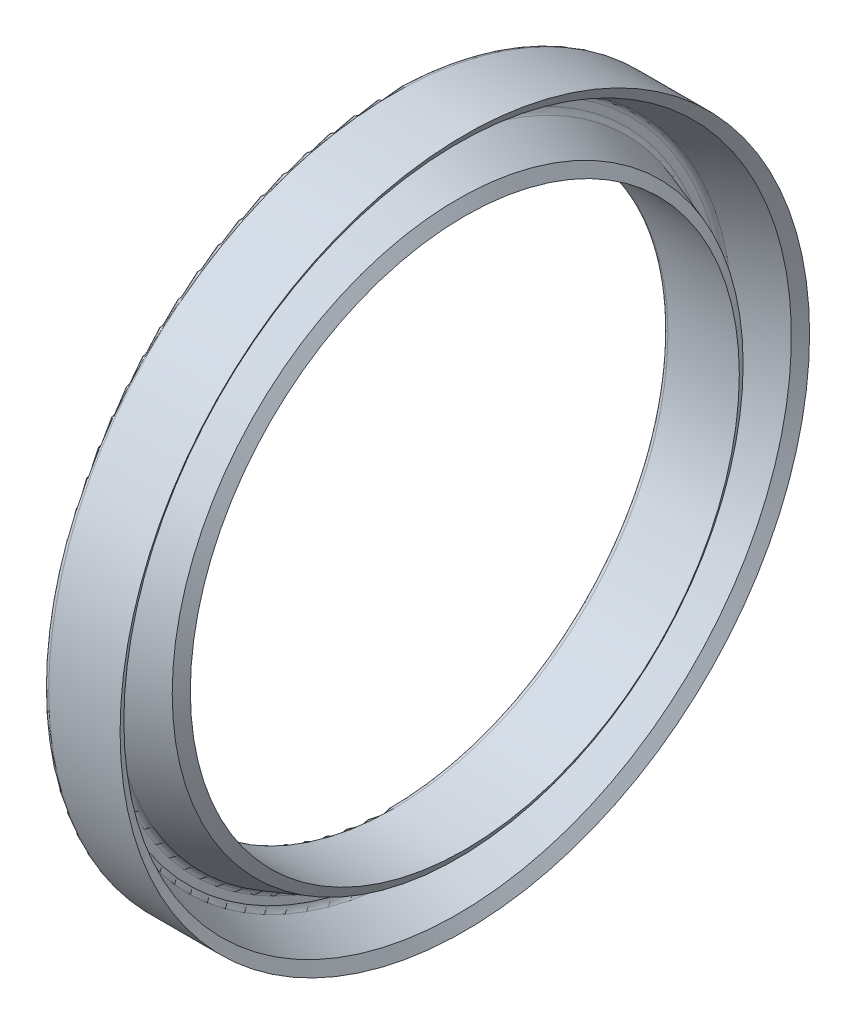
from build123d import *


with BuildPart() as part:
    # Esquisse1 → R_volution1 (revolve)
    with BuildSketch(Plane.XY, mode=Mode.PRIVATE) as r_volution1_sk:
        with BuildLine():
            Line((7, 31.4), (0.5, 31.4))
            ThreePointArc((0.5, 31.4), (0.146446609, 31.253553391), (0, 30.9))
            Line((0, 30.9), (0, 25.5))
            ThreePointArc((0, 25.5), (0.146446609, 25.146446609), (0.5, 25))
            Line((0.5, 25), (7, 25))
            Line((7, 25), (6.35, 26))
            Line((6.35, 26), (2.337004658, 27.383791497))
            ThreePointArc((2.337004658, 27.383791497), (2.092877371, 27.566217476), (2, 27.856477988))
            Line((2, 27.856477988), (2, 28.543618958))
            ThreePointArc((2, 28.543618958), (2.092840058, 28.833827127), (2.336883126, 29.016263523))
            Line((2.336883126, 29.016263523), (6.34637343, 30.4))
            Line((6.34637343, 30.4), (7, 31.4))
        make_face()
    revolve(r_volution1_sk.sketch.rotate(Axis((0, 0, 0), (1, 0, 0)), 90), axis=Axis((0, 0, 0), (1, 0, 0)))


solid = part.part
